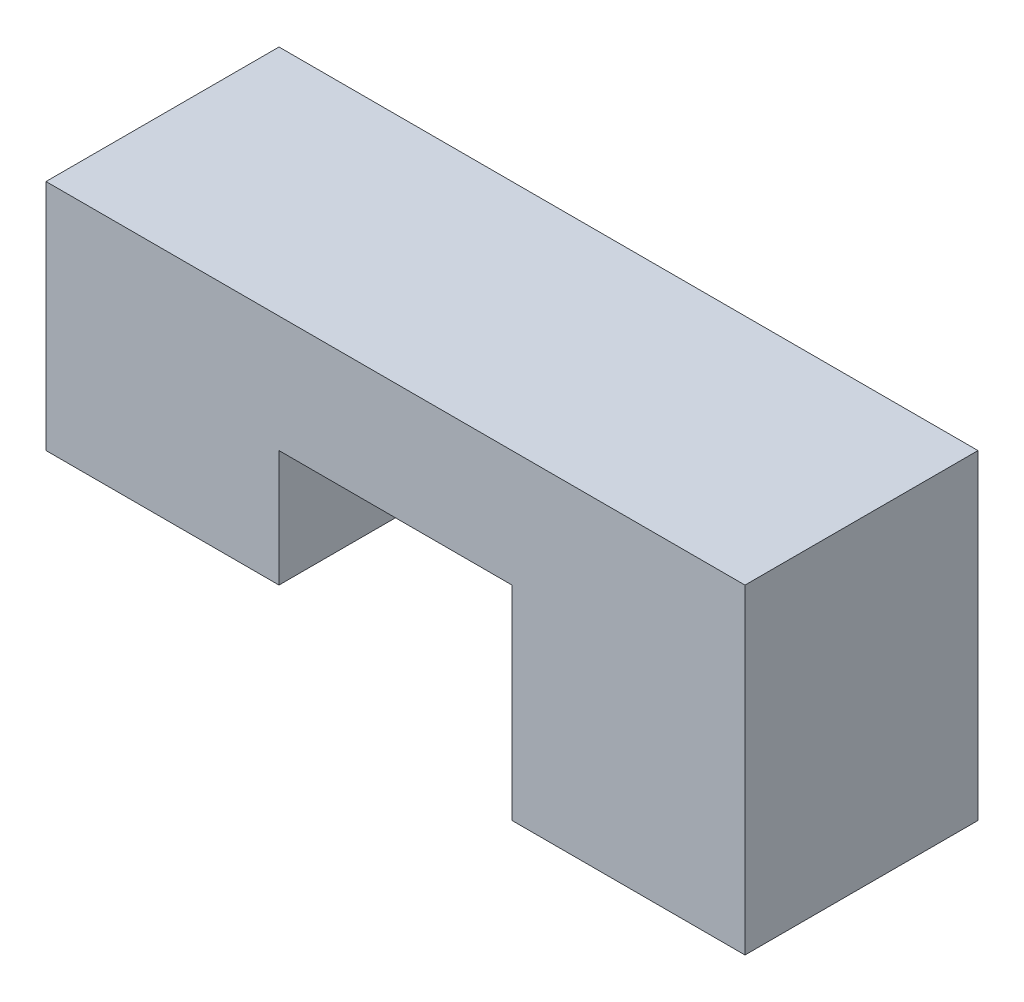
from build123d import *

# Parameters (mm, degrees)
SKETCH_1_W      = 120
SKETCH_1_H      = 40
EXTRUDE_1_DEPTH = 20
SKETCH_2_W      = 40
SKETCH_2_H      = 40
EXTRUDE_2_DEPTH = 40
SKETCH_3_W      = 40
SKETCH_3_H      = 40
EXTRUDE_3_DEPTH = 55


with BuildPart() as part:
    # Sketch 1 → Extrude 1 (new body)
    with BuildSketch(Plane(origin=(0, 0, 0), x_dir=(1, 0, 0), z_dir=(0, 1, 0))):
        Rectangle(SKETCH_1_W, SKETCH_1_H)
    extrude(amount=-EXTRUDE_1_DEPTH)

    # Sketch 2 → Extrude 2 (add)
    with BuildSketch(Plane(origin=(0, 0, 0), x_dir=(1, 0, 0), z_dir=(0, 1, 0))):
        with Locations((-40, 0)):
            Rectangle(SKETCH_2_W, SKETCH_2_H)
    extrude(amount=-EXTRUDE_2_DEPTH)

    # Sketch 3 → Extrude 3 (add)
    with BuildSketch(Plane(origin=(0, 0, 0), x_dir=(1, 0, 0), z_dir=(0, 1, 0))):
        with Locations((40, 0)):
            Rectangle(SKETCH_3_W, SKETCH_3_H)
    extrude(amount=-EXTRUDE_3_DEPTH)


solid = part.part
